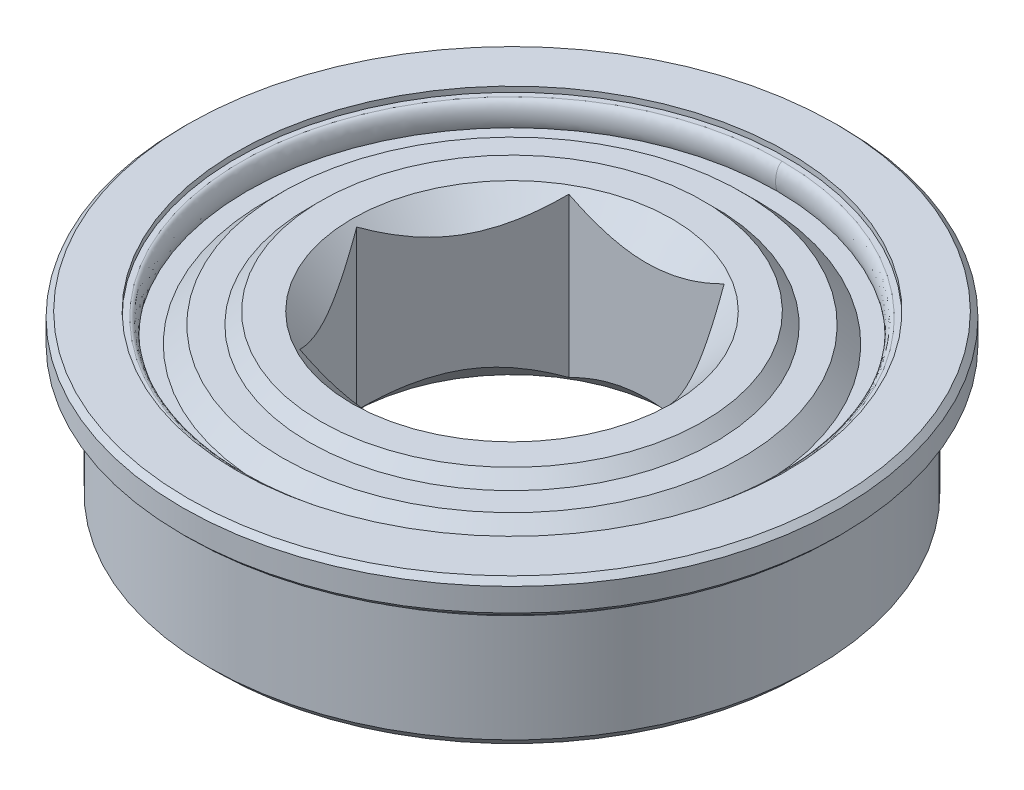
ISO-10303-21;
HEADER;
FILE_DESCRIPTION(('STEP AP214'),'2;1');
FILE_NAME('part.step','',(''),(''),'','','');
FILE_SCHEMA(('AUTOMOTIVE_DESIGN { 1 0 10303 214 1 1 1 1 }'));
ENDSEC;
DATA;
#1=APPLICATION_CONTEXT('core data for automotive mechanical design processes');
#2=APPLICATION_PROTOCOL_DEFINITION('international standard','automotive_design',2000,#1);
#3=PRODUCT_CONTEXT('',#1,'mechanical');
#4=PRODUCT('Part','Part','',(#3));
#5=PRODUCT_RELATED_PRODUCT_CATEGORY('part','',(#4));
#6=PRODUCT_DEFINITION_FORMATION('','',#4);
#7=PRODUCT_DEFINITION_CONTEXT('part definition',#1,'design');
#8=PRODUCT_DEFINITION('design','',#6,#7);
#9=PRODUCT_DEFINITION_SHAPE('','',#8);
#10=(LENGTH_UNIT() NAMED_UNIT(*) SI_UNIT(.MILLI.,.METRE.));
#11=(NAMED_UNIT(*) PLANE_ANGLE_UNIT() SI_UNIT($,.RADIAN.));
#12=(NAMED_UNIT(*) SI_UNIT($,.STERADIAN.) SOLID_ANGLE_UNIT());
#13=UNCERTAINTY_MEASURE_WITH_UNIT(LENGTH_MEASURE(1.E-05),#10,'distance_accuracy_value','');
#14=(GEOMETRIC_REPRESENTATION_CONTEXT(3) GLOBAL_UNCERTAINTY_ASSIGNED_CONTEXT((#13)) GLOBAL_UNIT_ASSIGNED_CONTEXT((#10,
#11,#12)) REPRESENTATION_CONTEXT('',''));
#15=CARTESIAN_POINT('',(0.,0.,0.));
#16=DIRECTION('',(0.,0.,1.));
#17=DIRECTION('',(1.,0.,0.));
#18=AXIS2_PLACEMENT_3D('',#15,#16,#17);
#19=CARTESIAN_POINT('',(0.,-0.254,-12.7635));
#20=CARTESIAN_POINT('',(-25.527,-0.253999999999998,-12.7635));
#21=CARTESIAN_POINT('',(-25.527,-0.254000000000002,12.7635));
#22=CARTESIAN_POINT('',(0.,-0.254,12.7635));
#23=CARTESIAN_POINT('',(0.,-0.254,-12.715836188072));
#24=CARTESIAN_POINT('',(-25.431672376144,-0.253999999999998,-12.715836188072));
#25=CARTESIAN_POINT('',(-25.4316723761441,-0.254000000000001,12.715836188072));
#26=CARTESIAN_POINT('',(0.,-0.254,12.715836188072));
#27=CARTESIAN_POINT('',(0.,-0.299750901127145,-12.6043840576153));
#28=CARTESIAN_POINT('',(-25.2087681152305,-0.299750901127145,-12.6043840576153));
#29=CARTESIAN_POINT('',(-25.2087681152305,-0.299750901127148,12.6043840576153));
#30=CARTESIAN_POINT('',(0.,-0.299750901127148,12.6043840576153));
#31=CARTESIAN_POINT('',(0.,-0.613709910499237,-12.4569624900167));
#32=CARTESIAN_POINT('',(-24.9139249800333,-0.613709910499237,-12.4569624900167));
#33=CARTESIAN_POINT('',(-24.9139249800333,-0.613709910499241,12.4569624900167));
#34=CARTESIAN_POINT('',(0.,-0.613709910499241,12.4569624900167));
#35=CARTESIAN_POINT('',(0.,-1.05375371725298,-12.432868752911));
#36=CARTESIAN_POINT('',(-24.8657375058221,-1.05375371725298,-12.432868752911));
#37=CARTESIAN_POINT('',(-24.8657375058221,-1.05375371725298,12.432868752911));
#38=CARTESIAN_POINT('',(0.,-1.05375371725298,12.432868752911));
#39=CARTESIAN_POINT('',(0.,-1.26712977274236,-12.4853764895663));
#40=CARTESIAN_POINT('',(-24.9707529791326,-1.26712977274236,-12.4853764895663));
#41=CARTESIAN_POINT('',(-24.9707529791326,-1.26712977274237,12.4853764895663));
#42=CARTESIAN_POINT('',(0.,-1.26712977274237,12.4853764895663));
#43=CARTESIAN_POINT('',(0.,-1.3462,-12.5150539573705));
#44=CARTESIAN_POINT('',(-25.030107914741,-1.3462,-12.5150539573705));
#45=CARTESIAN_POINT('',(-25.030107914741,-1.3462,12.5150539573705));
#46=CARTESIAN_POINT('',(0.,-1.3462,12.5150539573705));
#47=(BOUNDED_SURFACE() B_SPLINE_SURFACE(3,3,((#19,#20,#21,#22),(#23,#24,#25,#26),(#27,#28,#29,
#30),(#31,#32,#33,#34),(#35,#36,#37,#38),(#39,#40,#41,#42),(#43,#44,#45,#46)),.UNSPECIFIED.,.F.,
.F.,.F.) B_SPLINE_SURFACE_WITH_KNOTS((4,1,1,1,4),(4,4),(0.,0.25,0.5,0.75,1.),(0.,1.),
.UNSPECIFIED.) GEOMETRIC_REPRESENTATION_ITEM() RATIONAL_B_SPLINE_SURFACE(((1.,0.333333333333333,
0.333333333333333,1.),(1.,0.333333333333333,0.333333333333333,1.),(1.,0.333333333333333,
0.333333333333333,1.),(1.,0.333333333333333,0.333333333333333,1.),(1.,0.333333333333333,
0.333333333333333,1.),(1.,0.333333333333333,0.333333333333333,1.),(1.,0.333333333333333,
0.333333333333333,1.))) REPRESENTATION_ITEM('') SURFACE());
#48=CARTESIAN_POINT('',(0.,-0.254,0.));
#49=DIRECTION('',(0.,1.,0.));
#50=DIRECTION('',(0.,0.,1.));
#51=AXIS2_PLACEMENT_3D('',#48,#49,#50);
#52=CIRCLE('',#51,12.7635);
#53=CARTESIAN_POINT('',(0.,-0.254,-12.7635));
#54=VERTEX_POINT('',#53);
#55=CARTESIAN_POINT('',(0.,-0.254,12.7635));
#56=VERTEX_POINT('',#55);
#57=EDGE_CURVE('E518',#54,#56,#52,.T.);
#58=CARTESIAN_POINT('',(0.,-0.254,12.7635));
#59=CARTESIAN_POINT('',(0.,-0.254,12.715836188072));
#60=CARTESIAN_POINT('',(0.,-0.299750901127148,12.6043840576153));
#61=CARTESIAN_POINT('',(0.,-0.613709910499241,12.4569624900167));
#62=CARTESIAN_POINT('',(0.,-1.05375371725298,12.432868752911));
#63=CARTESIAN_POINT('',(0.,-1.26712977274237,12.4853764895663));
#64=CARTESIAN_POINT('',(0.,-1.3462,12.5150539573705));
#65=(BOUNDED_CURVE() B_SPLINE_CURVE(3,(#58,#59,#60,#61,#62,#63,#64),.UNSPECIFIED.,.F.,
.F.) B_SPLINE_CURVE_WITH_KNOTS((4,1,1,1,4),(0.,0.25,0.5,0.75,1.),
.UNSPECIFIED.) CURVE() GEOMETRIC_REPRESENTATION_ITEM() RATIONAL_B_SPLINE_CURVE((1.,1.,1.,1.,1.,
1.,1.)) REPRESENTATION_ITEM(''));
#66=CARTESIAN_POINT('',(0.,-1.3462,12.5150539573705));
#67=VERTEX_POINT('',#66);
#68=EDGE_CURVE('E476',#56,#67,#65,.T.);
#69=CARTESIAN_POINT('',(0.,-1.3462,0.));
#70=DIRECTION('',(0.,1.,0.));
#71=DIRECTION('',(0.,0.,1.));
#72=AXIS2_PLACEMENT_3D('',#69,#70,#71);
#73=CIRCLE('',#72,12.5150539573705);
#74=CARTESIAN_POINT('',(0.,-1.3462,-12.5150539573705));
#75=VERTEX_POINT('',#74);
#76=EDGE_CURVE('E521',#75,#67,#73,.T.);
#77=CARTESIAN_POINT('',(0.,-0.254,-12.7635));
#78=CARTESIAN_POINT('',(0.,-0.254,-12.715836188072));
#79=CARTESIAN_POINT('',(0.,-0.299750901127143,-12.6043840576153));
#80=CARTESIAN_POINT('',(0.,-0.613709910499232,-12.4569624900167));
#81=CARTESIAN_POINT('',(0.,-1.05375371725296,-12.432868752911));
#82=CARTESIAN_POINT('',(0.,-1.26712977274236,-12.4853764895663));
#83=CARTESIAN_POINT('',(0.,-1.3462,-12.5150539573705));
#84=(BOUNDED_CURVE() B_SPLINE_CURVE(3,(#77,#78,#79,#80,#81,#82,#83),.UNSPECIFIED.,.F.,
.F.) B_SPLINE_CURVE_WITH_KNOTS((4,1,1,1,4),(0.,0.25,0.5,0.75,1.),
.UNSPECIFIED.) CURVE() GEOMETRIC_REPRESENTATION_ITEM() RATIONAL_B_SPLINE_CURVE((1.,1.,1.,1.,1.,
1.,1.)) REPRESENTATION_ITEM(''));
#85=EDGE_CURVE('E517',#54,#75,#84,.T.);
#86=ORIENTED_EDGE('',*,*,#57,.T.);
#87=ORIENTED_EDGE('',*,*,#68,.T.);
#88=ORIENTED_EDGE('',*,*,#76,.F.);
#89=ORIENTED_EDGE('',*,*,#85,.F.);
#90=EDGE_LOOP('',(#86,#87,#88,#89));
#91=FACE_BOUND('',#90,.T.);
#92=ADVANCED_FACE('F16',(#91),#47,.F.);
#93=CARTESIAN_POINT('',(0.,-7.6835,12.7635));
#94=CARTESIAN_POINT('',(25.527,-7.6835,12.7635));
#95=CARTESIAN_POINT('',(25.527,-7.6835,-12.7635));
#96=CARTESIAN_POINT('',(0.,-7.6835,-12.7635));
#97=CARTESIAN_POINT('',(0.,-7.6835,12.715836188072));
#98=CARTESIAN_POINT('',(25.431672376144,-7.6835,12.715836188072));
#99=CARTESIAN_POINT('',(25.431672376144,-7.6835,-12.715836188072));
#100=CARTESIAN_POINT('',(0.,-7.6835,-12.715836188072));
#101=CARTESIAN_POINT('',(0.,-7.63774909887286,12.6043840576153));
#102=CARTESIAN_POINT('',(25.2087681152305,-7.63774909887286,12.6043840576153));
#103=CARTESIAN_POINT('',(25.2087681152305,-7.63774909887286,-12.6043840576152));
#104=CARTESIAN_POINT('',(0.,-7.63774909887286,-12.6043840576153));
#105=CARTESIAN_POINT('',(0.,-7.32379008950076,12.4569624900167));
#106=CARTESIAN_POINT('',(24.9139249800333,-7.32379008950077,12.4569624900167));
#107=CARTESIAN_POINT('',(24.9139249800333,-7.32379008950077,-12.4569624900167));
#108=CARTESIAN_POINT('',(0.,-7.32379008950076,-12.4569624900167));
#109=CARTESIAN_POINT('',(0.,-6.88374628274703,12.432868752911));
#110=CARTESIAN_POINT('',(24.8657375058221,-6.88374628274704,12.432868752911));
#111=CARTESIAN_POINT('',(24.8657375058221,-6.88374628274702,-12.432868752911));
#112=CARTESIAN_POINT('',(0.,-6.88374628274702,-12.432868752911));
#113=CARTESIAN_POINT('',(0.,-6.67037022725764,12.4853764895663));
#114=CARTESIAN_POINT('',(24.9707529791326,-6.67037022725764,12.4853764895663));
#115=CARTESIAN_POINT('',(24.9707529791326,-6.67037022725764,-12.4853764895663));
#116=CARTESIAN_POINT('',(0.,-6.67037022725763,-12.4853764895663));
#117=CARTESIAN_POINT('',(0.,-6.5913,12.5150539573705));
#118=CARTESIAN_POINT('',(25.030107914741,-6.59130000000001,12.5150539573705));
#119=CARTESIAN_POINT('',(25.030107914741,-6.59130000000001,-12.5150539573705));
#120=CARTESIAN_POINT('',(0.,-6.5913,-12.5150539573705));
#121=(BOUNDED_SURFACE() B_SPLINE_SURFACE(3,3,((#93,#94,#95,#96),(#97,#98,#99,#100),(#101,#102,
#103,#104),(#105,#106,#107,#108),(#109,#110,#111,#112),(#113,#114,#115,#116),(#117,#118,#119,
#120)),.UNSPECIFIED.,.F.,.F.,.F.) B_SPLINE_SURFACE_WITH_KNOTS((4,1,1,1,4),(4,4),(0.,0.25,0.5,
0.75,1.),(0.,1.),.UNSPECIFIED.) GEOMETRIC_REPRESENTATION_ITEM() RATIONAL_B_SPLINE_SURFACE(((1.,
0.333333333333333,0.333333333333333,1.),(1.,0.333333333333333,0.333333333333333,1.),(1.,
0.333333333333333,0.333333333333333,1.),(1.,0.333333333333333,0.333333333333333,1.),(1.,
0.333333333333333,0.333333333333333,1.),(1.,0.333333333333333,0.333333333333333,1.),(1.,
0.333333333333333,0.333333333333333,1.))) REPRESENTATION_ITEM('') SURFACE());
#122=CARTESIAN_POINT('',(0.,-7.6835,0.));
#123=DIRECTION('',(0.,1.,0.));
#124=DIRECTION('',(0.,0.,1.));
#125=AXIS2_PLACEMENT_3D('',#122,#123,#124);
#126=CIRCLE('',#125,12.7635);
#127=CARTESIAN_POINT('',(0.,-7.6835,12.7635));
#128=VERTEX_POINT('',#127);
#129=CARTESIAN_POINT('',(0.,-7.6835,-12.7635));
#130=VERTEX_POINT('',#129);
#131=EDGE_CURVE('E661',#128,#130,#126,.T.);
#132=CARTESIAN_POINT('',(0.,-7.6835,12.7635));
#133=CARTESIAN_POINT('',(0.,-7.6835,12.715836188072));
#134=CARTESIAN_POINT('',(0.,-7.63774909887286,12.6043840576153));
#135=CARTESIAN_POINT('',(0.,-7.32379008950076,12.4569624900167));
#136=CARTESIAN_POINT('',(0.,-6.88374628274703,12.432868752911));
#137=CARTESIAN_POINT('',(0.,-6.67037022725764,12.4853764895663));
#138=CARTESIAN_POINT('',(0.,-6.5913,12.5150539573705));
#139=(BOUNDED_CURVE() B_SPLINE_CURVE(3,(#132,#133,#134,#135,#136,#137,#138),.UNSPECIFIED.,.F.,
.F.) B_SPLINE_CURVE_WITH_KNOTS((4,1,1,1,4),(0.,0.25,0.5,0.75,1.),
.UNSPECIFIED.) CURVE() GEOMETRIC_REPRESENTATION_ITEM() RATIONAL_B_SPLINE_CURVE((1.,1.,1.,1.,1.,
1.,1.)) REPRESENTATION_ITEM(''));
#140=CARTESIAN_POINT('',(0.,-6.5913,12.5150539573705));
#141=VERTEX_POINT('',#140);
#142=EDGE_CURVE('E632',#128,#141,#139,.T.);
#143=CARTESIAN_POINT('',(0.,-6.5913,0.));
#144=DIRECTION('',(0.,1.,0.));
#145=DIRECTION('',(0.,0.,1.));
#146=AXIS2_PLACEMENT_3D('',#143,#144,#145);
#147=CIRCLE('',#146,12.5150539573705);
#148=CARTESIAN_POINT('',(0.,-6.5913,-12.5150539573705));
#149=VERTEX_POINT('',#148);
#150=EDGE_CURVE('E677',#141,#149,#147,.T.);
#151=CARTESIAN_POINT('',(0.,-7.6835,-12.7635));
#152=CARTESIAN_POINT('',(0.,-7.6835,-12.715836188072));
#153=CARTESIAN_POINT('',(0.,-7.63774909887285,-12.6043840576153));
#154=CARTESIAN_POINT('',(0.,-7.32379008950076,-12.4569624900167));
#155=CARTESIAN_POINT('',(0.,-6.88374628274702,-12.432868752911));
#156=CARTESIAN_POINT('',(0.,-6.67037022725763,-12.4853764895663));
#157=CARTESIAN_POINT('',(0.,-6.5913,-12.5150539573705));
#158=(BOUNDED_CURVE() B_SPLINE_CURVE(3,(#151,#152,#153,#154,#155,#156,#157),.UNSPECIFIED.,.F.,
.F.) B_SPLINE_CURVE_WITH_KNOTS((4,1,1,1,4),(0.,0.25,0.5,0.75,1.),
.UNSPECIFIED.) CURVE() GEOMETRIC_REPRESENTATION_ITEM() RATIONAL_B_SPLINE_CURVE((0.999999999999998,
0.999999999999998,0.999999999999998,0.999999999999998,0.999999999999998,0.999999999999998,0.999999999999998)) REPRESENTATION_ITEM(''));
#159=EDGE_CURVE('E586',#130,#149,#158,.T.);
#160=ORIENTED_EDGE('',*,*,#131,.F.);
#161=ORIENTED_EDGE('',*,*,#142,.T.);
#162=ORIENTED_EDGE('',*,*,#150,.T.);
#163=ORIENTED_EDGE('',*,*,#159,.F.);
#164=EDGE_LOOP('',(#160,#161,#162,#163));
#165=FACE_BOUND('',#164,.T.);
#166=ADVANCED_FACE('F437',(#165),#121,.T.);
#167=CARTESIAN_POINT('',(0.,-1.7272,0.));
#168=DIRECTION('',(0.,-1.,0.));
#169=DIRECTION('',(0.,0.,-1.));
#170=AXIS2_PLACEMENT_3D('',#167,#168,#169);
#171=TOROIDAL_SURFACE('',#170,14.224,0.127);
#172=CARTESIAN_POINT('',(0.,-1.7272,0.));
#173=DIRECTION('',(0.,-1.,0.));
#174=DIRECTION('',(0.,0.,-1.));
#175=AXIS2_PLACEMENT_3D('',#172,#173,#174);
#176=CIRCLE('',#175,14.097);
#177=CARTESIAN_POINT('',(0.,-1.7272,-14.097));
#178=VERTEX_POINT('',#177);
#179=EDGE_CURVE('E563',#178,#178,#176,.T.);
#180=ORIENTED_EDGE('',*,*,#179,.F.);
#181=EDGE_LOOP('',(#180));
#182=FACE_BOUND('',#181,.T.);
#183=CARTESIAN_POINT('',(0.,-1.6002,0.));
#184=DIRECTION('',(0.,1.,0.));
#185=DIRECTION('',(0.,0.,-1.));
#186=AXIS2_PLACEMENT_3D('',#183,#184,#185);
#187=CIRCLE('',#186,14.224);
#188=CARTESIAN_POINT('',(0.,-1.6002,-14.224));
#189=VERTEX_POINT('',#188);
#190=EDGE_CURVE('E571',#189,#189,#187,.T.);
#191=ORIENTED_EDGE('',*,*,#190,.F.);
#192=EDGE_LOOP('',(#191));
#193=FACE_BOUND('',#192,.T.);
#194=ADVANCED_FACE('F443',(#182,#193),#171,.F.);
#195=CARTESIAN_POINT('',(0.,-6.5913,0.));
#196=DIRECTION('',(0.,1.,0.));
#197=DIRECTION('',(0.,0.,1.));
#198=AXIS2_PLACEMENT_3D('',#195,#196,#197);
#199=CONICAL_SURFACE('',#198,11.6447517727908,0.78539816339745);
#200=CARTESIAN_POINT('',(0.,-7.37755177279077,0.));
#201=DIRECTION('',(0.,1.,0.));
#202=DIRECTION('',(0.,0.,1.));
#203=AXIS2_PLACEMENT_3D('',#200,#201,#202);
#204=CIRCLE('',#203,10.8585);
#205=CARTESIAN_POINT('',(0.,-7.37755177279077,10.8585));
#206=VERTEX_POINT('',#205);
#207=EDGE_CURVE('E777',#206,#206,#204,.T.);
#208=ORIENTED_EDGE('',*,*,#207,.T.);
#209=EDGE_LOOP('',(#208));
#210=FACE_BOUND('',#209,.T.);
#211=CARTESIAN_POINT('',(0.,-6.5913,0.));
#212=DIRECTION('',(0.,1.,0.));
#213=DIRECTION('',(0.,0.,1.));
#214=AXIS2_PLACEMENT_3D('',#211,#212,#213);
#215=CIRCLE('',#214,11.6447517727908);
#216=CARTESIAN_POINT('',(0.,-6.5913,11.6447517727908));
#217=VERTEX_POINT('',#216);
#218=EDGE_CURVE('E680',#217,#217,#215,.T.);
#219=ORIENTED_EDGE('',*,*,#218,.F.);
#220=EDGE_LOOP('',(#219));
#221=FACE_BOUND('',#220,.T.);
#222=ADVANCED_FACE('F18',(#210,#221),#199,.T.);
#223=CARTESIAN_POINT('',(0.,-7.37755177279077,0.));
#224=DIRECTION('',(0.,1.,0.));
#225=DIRECTION('',(0.,0.,1.));
#226=AXIS2_PLACEMENT_3D('',#223,#224,#225);
#227=CONICAL_SURFACE('',#226,9.5885,0.785398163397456);
#228=CARTESIAN_POINT('',(0.,-7.9375,0.));
#229=DIRECTION('',(0.,1.,0.));
#230=DIRECTION('',(0.,0.,1.));
#231=AXIS2_PLACEMENT_3D('',#228,#229,#230);
#232=CIRCLE('',#231,9.02855177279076);
#233=CARTESIAN_POINT('',(0.,-7.9375,9.02855177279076));
#234=VERTEX_POINT('',#233);
#235=EDGE_CURVE('E786',#234,#234,#232,.T.);
#236=ORIENTED_EDGE('',*,*,#235,.T.);
#237=EDGE_LOOP('',(#236));
#238=FACE_BOUND('',#237,.T.);
#239=CARTESIAN_POINT('',(0.,-7.37755177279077,0.));
#240=DIRECTION('',(0.,1.,0.));
#241=DIRECTION('',(0.,0.,1.));
#242=AXIS2_PLACEMENT_3D('',#239,#240,#241);
#243=CIRCLE('',#242,9.5885);
#244=CARTESIAN_POINT('',(0.,-7.37755177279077,9.5885));
#245=VERTEX_POINT('',#244);
#246=EDGE_CURVE('E780',#245,#245,#243,.T.);
#247=ORIENTED_EDGE('',*,*,#246,.F.);
#248=EDGE_LOOP('',(#247));
#249=FACE_BOUND('',#248,.T.);
#250=ADVANCED_FACE('F650',(#238,#249),#227,.T.);
#251=CARTESIAN_POINT('',(0.,-7.9375,0.));
#252=DIRECTION('',(0.,-1.,0.));
#253=DIRECTION('',(0.,0.,-1.));
#254=AXIS2_PLACEMENT_3D('',#251,#252,#253);
#255=CONICAL_SURFACE('',#254,7.5565,0.785398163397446);
#256=CARTESIAN_POINT('',(3.66617412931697,-7.71334837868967,6.35));
#257=CARTESIAN_POINT('',(2.73007217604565,-7.24529740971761,6.35));
#258=CARTESIAN_POINT('',(1.90239615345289,-7.00984689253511,6.35));
#259=CARTESIAN_POINT('',(0.9325645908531,-6.73395712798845,6.35));
#260=CARTESIAN_POINT('',(0.0148101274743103,-6.73101727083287,6.35));
#261=CARTESIAN_POINT('',(-0.90417224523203,-6.72807348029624,6.35));
#262=CARTESIAN_POINT('',(-1.8766583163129,-7.00250635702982,6.35));
#263=CARTESIAN_POINT('',(-2.72107309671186,-7.24079787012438,6.35));
#264=CARTESIAN_POINT('',(-3.66617412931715,-7.71334837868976,6.35));
#265=B_SPLINE_CURVE_WITH_KNOTS('',2,(#256,#257,#258,#259,#260,#261,#262,#263,#264),
.UNSPECIFIED.,.F.,.F.,(3,2,2,2,3),(0.,0.25,0.5,0.75,1.),.UNSPECIFIED.);
#266=CARTESIAN_POINT('',(3.66617422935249,-7.71334839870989,6.34999996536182));
#267=VERTEX_POINT('',#266);
#268=CARTESIAN_POINT('',(-3.6661742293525,-7.71334839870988,6.34999996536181));
#269=VERTEX_POINT('',#268);
#270=EDGE_CURVE('E694',#267,#269,#265,.T.);
#271=ORIENTED_EDGE('',*,*,#270,.F.);
#272=CARTESIAN_POINT('',(7.33234837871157,-7.71334837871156,6.92762852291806E-08));
#273=CARTESIAN_POINT('',(6.86385630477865,-7.24485631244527,0.811452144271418));
#274=CARTESIAN_POINT('',(6.44960505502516,-7.00935672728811,1.52895635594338));
#275=CARTESIAN_POINT('',(5.964880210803,-6.73379328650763,2.36852441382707));
#276=CARTESIAN_POINT('',(5.5060085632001,-6.73101433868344,3.16331342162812));
#277=CARTESIAN_POINT('',(5.04687441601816,-6.72823380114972,3.95855709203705));
#278=CARTESIAN_POINT('',(4.56118158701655,-7.00236498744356,4.7998017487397));
#279=CARTESIAN_POINT('',(4.13870846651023,-7.24081416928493,5.53154665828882));
#280=CARTESIAN_POINT('',(3.66617424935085,-7.71334837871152,6.34999993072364));
#281=B_SPLINE_CURVE_WITH_KNOTS('',2,(#272,#273,#274,#275,#276,#277,#278,#279,#280),
.UNSPECIFIED.,.F.,.F.,(3,2,2,2,3),(0.,0.25,0.5,0.75,1.),.UNSPECIFIED.);
#282=CARTESIAN_POINT('',(7.33234839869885,-7.71334839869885,-3.46572928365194E-08));
#283=VERTEX_POINT('',#282);
#284=EDGE_CURVE('E685',#283,#267,#281,.T.);
#285=ORIENTED_EDGE('',*,*,#284,.F.);
#286=CARTESIAN_POINT('',(3.66617424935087,-7.71334837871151,-6.34999993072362));
#287=CARTESIAN_POINT('',(4.13466632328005,-7.24485631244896,-5.53854785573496));
#288=CARTESIAN_POINT('',(4.54891757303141,-7.00935672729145,-4.8210436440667));
#289=CARTESIAN_POINT('',(5.03364241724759,-6.73379328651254,-3.98147558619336));
#290=CARTESIAN_POINT('',(5.49251406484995,-6.7310143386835,-3.18668657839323));
#291=CARTESIAN_POINT('',(5.95164821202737,-6.72823380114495,-2.39144290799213));
#292=CARTESIAN_POINT('',(6.43734104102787,-7.00236498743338,-1.5501982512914));
#293=CARTESIAN_POINT('',(6.85981416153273,-7.24081416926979,-0.818453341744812));
#294=CARTESIAN_POINT('',(7.33234837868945,-7.71334837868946,-6.93145876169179E-08));
#295=B_SPLINE_CURVE_WITH_KNOTS('',2,(#286,#287,#288,#289,#290,#291,#292,#293,#294),
.UNSPECIFIED.,.F.,.F.,(3,2,2,2,3),(0.,0.25,0.5,0.75,1.),.UNSPECIFIED.);
#296=CARTESIAN_POINT('',(3.66617416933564,-7.71334839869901,-6.35));
#297=VERTEX_POINT('',#296);
#298=EDGE_CURVE('E365',#297,#283,#295,.T.);
#299=ORIENTED_EDGE('',*,*,#298,.F.);
#300=CARTESIAN_POINT('',(-3.66617412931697,-7.71334837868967,-6.35));
#301=CARTESIAN_POINT('',(-2.7300721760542,-7.24529740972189,-6.35));
#302=CARTESIAN_POINT('',(-1.90239615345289,-7.0098468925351,-6.35));
#303=CARTESIAN_POINT('',(-0.93256459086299,-6.73395712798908,-6.35));
#304=CARTESIAN_POINT('',(-0.0148101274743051,-6.73101727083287,-6.35));
#305=CARTESIAN_POINT('',(0.90417224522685,-6.72807348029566,-6.35));
#306=CARTESIAN_POINT('',(1.8766583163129,-7.00250635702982,-6.35));
#307=CARTESIAN_POINT('',(2.72107309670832,-7.24079787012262,-6.35));
#308=CARTESIAN_POINT('',(3.66617412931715,-7.71334837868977,-6.35));
#309=B_SPLINE_CURVE_WITH_KNOTS('',2,(#300,#301,#302,#303,#304,#305,#306,#307,#308),
.UNSPECIFIED.,.F.,.F.,(3,2,2,2,3),(0.,0.25,0.5,0.75,1.),.UNSPECIFIED.);
#310=CARTESIAN_POINT('',(-3.66617422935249,-7.71334839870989,-6.34999996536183));
#311=VERTEX_POINT('',#310);
#312=EDGE_CURVE('E239',#311,#297,#309,.T.);
#313=ORIENTED_EDGE('',*,*,#312,.F.);
#314=CARTESIAN_POINT('',(-7.33234837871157,-7.71334837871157,-6.92762852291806E-08));
#315=CARTESIAN_POINT('',(-6.86385630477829,-7.24485631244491,-0.811452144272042));
#316=CARTESIAN_POINT('',(-6.44960505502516,-7.00935672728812,-1.52895635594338));
#317=CARTESIAN_POINT('',(-5.96488021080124,-6.73379328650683,-2.3685244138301));
#318=CARTESIAN_POINT('',(-5.5060085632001,-6.73101433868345,-3.16331342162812));
#319=CARTESIAN_POINT('',(-5.04687441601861,-6.72823380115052,-3.95855709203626));
#320=CARTESIAN_POINT('',(-4.56118158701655,-7.00236498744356,-4.7998017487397));
#321=CARTESIAN_POINT('',(-4.13870846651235,-7.24081416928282,-5.53154665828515));
#322=CARTESIAN_POINT('',(-3.66617424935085,-7.71334837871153,-6.34999993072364));
#323=B_SPLINE_CURVE_WITH_KNOTS('',2,(#314,#315,#316,#317,#318,#319,#320,#321,#322),
.UNSPECIFIED.,.F.,.F.,(3,2,2,2,3),(0.,0.25,0.5,0.75,1.),.UNSPECIFIED.);
#324=CARTESIAN_POINT('',(-7.33234839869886,-7.71334839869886,3.46572921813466E-08));
#325=VERTEX_POINT('',#324);
#326=EDGE_CURVE('E234',#325,#311,#323,.T.);
#327=ORIENTED_EDGE('',*,*,#326,.F.);
#328=CARTESIAN_POINT('',(-3.66617424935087,-7.71334837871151,6.34999993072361));
#329=CARTESIAN_POINT('',(-4.13466632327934,-7.24485631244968,5.53854785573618));
#330=CARTESIAN_POINT('',(-4.54891757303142,-7.00935672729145,4.82104364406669));
#331=CARTESIAN_POINT('',(-5.03364241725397,-6.73379328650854,3.9814755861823));
#332=CARTESIAN_POINT('',(-5.49251406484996,-6.7310143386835,3.18668657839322));
#333=CARTESIAN_POINT('',(-5.95164821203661,-6.72823380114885,2.39144290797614));
#334=CARTESIAN_POINT('',(-6.43734104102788,-7.00236498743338,1.55019825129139));
#335=CARTESIAN_POINT('',(-6.85981416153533,-7.24081416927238,0.818453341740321));
#336=CARTESIAN_POINT('',(-7.33234837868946,-7.71334837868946,6.93145828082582E-08));
#337=B_SPLINE_CURVE_WITH_KNOTS('',2,(#328,#329,#330,#331,#332,#333,#334,#335,#336),
.UNSPECIFIED.,.F.,.F.,(3,2,2,2,3),(0.,0.25,0.5,0.75,1.),.UNSPECIFIED.);
#338=EDGE_CURVE('E216',#269,#325,#337,.T.);
#339=ORIENTED_EDGE('',*,*,#338,.F.);
#340=EDGE_LOOP('',(#271,#285,#299,#313,#327,#339));
#341=FACE_BOUND('',#340,.T.);
#342=CARTESIAN_POINT('',(0.,-7.9375,0.));
#343=DIRECTION('',(0.,1.,0.));
#344=DIRECTION('',(0.,0.,1.));
#345=AXIS2_PLACEMENT_3D('',#342,#343,#344);
#346=CIRCLE('',#345,7.5565);
#347=CARTESIAN_POINT('',(0.,-7.9375,7.5565));
#348=VERTEX_POINT('',#347);
#349=EDGE_CURVE('E783',#348,#348,#346,.T.);
#350=ORIENTED_EDGE('',*,*,#349,.F.);
#351=EDGE_LOOP('',(#350));
#352=FACE_BOUND('',#351,.T.);
#353=ADVANCED_FACE('F236',(#341,#352),#255,.F.);
#354=CARTESIAN_POINT('',(0.,-1.2065,0.));
#355=DIRECTION('',(0.,1.,0.));
#356=DIRECTION('',(0.,0.,1.));
#357=AXIS2_PLACEMENT_3D('',#354,#355,#356);
#358=CONICAL_SURFACE('',#357,6.35,0.785398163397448);
#359=CARTESIAN_POINT('',(3.66617412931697,-0.22415162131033,-6.35));
#360=CARTESIAN_POINT('',(2.73007217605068,-0.692202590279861,-6.35));
#361=CARTESIAN_POINT('',(1.90239615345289,-0.92765310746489,-6.35));
#362=CARTESIAN_POINT('',(0.93256459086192,-1.20354287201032,-6.35));
#363=CARTESIAN_POINT('',(0.0148101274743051,-1.20648272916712,-6.35));
#364=CARTESIAN_POINT('',(-0.90417224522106,-1.20942651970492,-6.35));
#365=CARTESIAN_POINT('',(-1.8766583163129,-0.93499364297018,-6.35));
#366=CARTESIAN_POINT('',(-2.72107309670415,-0.69670212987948,-6.35));
#367=CARTESIAN_POINT('',(-3.66617412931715,-0.22415162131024,-6.35));
#368=B_SPLINE_CURVE_WITH_KNOTS('',2,(#359,#360,#361,#362,#363,#364,#365,#366,#367),
.UNSPECIFIED.,.F.,.F.,(3,2,2,2,3),(0.,0.25,0.5,0.75,1.),.UNSPECIFIED.);
#369=CARTESIAN_POINT('',(3.66617422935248,-0.224151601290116,-6.34999996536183));
#370=VERTEX_POINT('',#369);
#371=CARTESIAN_POINT('',(-3.6661742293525,-0.22415160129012,-6.34999996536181));
#372=VERTEX_POINT('',#371);
#373=EDGE_CURVE('E398',#370,#372,#368,.T.);
#374=ORIENTED_EDGE('',*,*,#373,.F.);
#375=CARTESIAN_POINT('',(7.33234837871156,-0.22415162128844,-6.92762920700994E-08));
#376=CARTESIAN_POINT('',(6.86385630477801,-0.692643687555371,-0.811452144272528));
#377=CARTESIAN_POINT('',(6.44960505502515,-0.92814327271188,-1.52895635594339));
#378=CARTESIAN_POINT('',(5.964880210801,-1.20370671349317,-2.36852441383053));
#379=CARTESIAN_POINT('',(5.5060085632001,-1.20648566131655,-3.16331342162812));
#380=CARTESIAN_POINT('',(5.04687441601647,-1.20926619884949,-3.95855709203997));
#381=CARTESIAN_POINT('',(4.56118158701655,-0.935135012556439,-4.79980174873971));
#382=CARTESIAN_POINT('',(4.13870846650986,-0.696685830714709,-5.53154665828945));
#383=CARTESIAN_POINT('',(3.66617424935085,-0.224151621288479,-6.34999993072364));
#384=B_SPLINE_CURVE_WITH_KNOTS('',2,(#375,#376,#377,#378,#379,#380,#381,#382,#383),
.UNSPECIFIED.,.F.,.F.,(3,2,2,2,3),(0.,0.25,0.5,0.75,1.),.UNSPECIFIED.);
#385=CARTESIAN_POINT('',(7.33234839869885,-0.224151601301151,3.46572916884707E-08));
#386=VERTEX_POINT('',#385);
#387=EDGE_CURVE('E393',#386,#370,#384,.T.);
#388=ORIENTED_EDGE('',*,*,#387,.F.);
#389=CARTESIAN_POINT('',(3.66617424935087,-0.224151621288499,6.34999993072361));
#390=CARTESIAN_POINT('',(4.13466632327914,-0.692643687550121,5.53854785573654));
#391=CARTESIAN_POINT('',(4.54891757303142,-0.928143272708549,4.82104364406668));
#392=CARTESIAN_POINT('',(5.03364241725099,-1.20370671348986,3.98147558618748));
#393=CARTESIAN_POINT('',(5.49251406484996,-1.2064856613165,3.18668657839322));
#394=CARTESIAN_POINT('',(5.95164821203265,-1.2092661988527,2.391442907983));
#395=CARTESIAN_POINT('',(6.43734104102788,-0.935135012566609,1.55019825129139));
#396=CARTESIAN_POINT('',(6.85981416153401,-0.696685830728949,0.818453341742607));
#397=CARTESIAN_POINT('',(7.33234837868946,-0.224151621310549,6.93145827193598E-08));
#398=B_SPLINE_CURVE_WITH_KNOTS('',2,(#389,#390,#391,#392,#393,#394,#395,#396,#397),
.UNSPECIFIED.,.F.,.F.,(3,2,2,2,3),(0.,0.25,0.5,0.75,1.),.UNSPECIFIED.);
#399=CARTESIAN_POINT('',(3.66617416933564,-0.224151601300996,6.35));
#400=VERTEX_POINT('',#399);
#401=EDGE_CURVE('E395',#400,#386,#398,.T.);
#402=ORIENTED_EDGE('',*,*,#401,.F.);
#403=CARTESIAN_POINT('',(-3.66617412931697,-0.22415162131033,6.35));
#404=CARTESIAN_POINT('',(-2.73007217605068,-0.69220259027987,6.35));
#405=CARTESIAN_POINT('',(-1.90239615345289,-0.92765310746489,6.35));
#406=CARTESIAN_POINT('',(-0.93256459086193,-1.20354287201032,6.35));
#407=CARTESIAN_POINT('',(-0.0148101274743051,-1.20648272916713,6.35));
#408=CARTESIAN_POINT('',(0.90417224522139,-1.20942651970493,6.35));
#409=CARTESIAN_POINT('',(1.8766583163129,-0.93499364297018,6.35));
#410=CARTESIAN_POINT('',(2.72107309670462,-0.69670212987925,6.35));
#411=CARTESIAN_POINT('',(3.66617412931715,-0.22415162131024,6.35));
#412=B_SPLINE_CURVE_WITH_KNOTS('',2,(#403,#404,#405,#406,#407,#408,#409,#410,#411),
.UNSPECIFIED.,.F.,.F.,(3,2,2,2,3),(0.,0.25,0.5,0.75,1.),.UNSPECIFIED.);
#413=CARTESIAN_POINT('',(-3.66617422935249,-0.224151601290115,6.34999996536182));
#414=VERTEX_POINT('',#413);
#415=EDGE_CURVE('E230',#414,#400,#412,.T.);
#416=ORIENTED_EDGE('',*,*,#415,.F.);
#417=CARTESIAN_POINT('',(-7.33234837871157,-0.22415162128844,6.92762885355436E-08));
#418=CARTESIAN_POINT('',(-6.86385630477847,-0.692643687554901,0.811452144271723));
#419=CARTESIAN_POINT('',(-6.44960505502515,-0.92814327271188,1.52895635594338));
#420=CARTESIAN_POINT('',(-5.9648802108,-1.20370671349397,2.36852441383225));
#421=CARTESIAN_POINT('',(-5.5060085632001,-1.20648566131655,3.16331342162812));
#422=CARTESIAN_POINT('',(-5.04687441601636,-1.2092661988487,3.95855709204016));
#423=CARTESIAN_POINT('',(-4.56118158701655,-0.93513501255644,4.7998017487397));
#424=CARTESIAN_POINT('',(-4.13870846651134,-0.69668583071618,5.5315466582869));
#425=CARTESIAN_POINT('',(-3.66617424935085,-0.22415162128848,6.34999993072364));
#426=B_SPLINE_CURVE_WITH_KNOTS('',2,(#417,#418,#419,#420,#421,#422,#423,#424,#425),
.UNSPECIFIED.,.F.,.F.,(3,2,2,2,3),(0.,0.25,0.5,0.75,1.),.UNSPECIFIED.);
#427=CARTESIAN_POINT('',(-7.33234839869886,-0.224151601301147,-3.46572903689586E-08));
#428=VERTEX_POINT('',#427);
#429=EDGE_CURVE('E246',#428,#414,#426,.T.);
#430=ORIENTED_EDGE('',*,*,#429,.F.);
#431=CARTESIAN_POINT('',(-3.66617424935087,-0.224151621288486,-6.34999993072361));
#432=CARTESIAN_POINT('',(-4.1346663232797,-0.692643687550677,-5.53854785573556));
#433=CARTESIAN_POINT('',(-4.54891757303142,-0.928143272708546,-4.82104364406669));
#434=CARTESIAN_POINT('',(-5.03364241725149,-1.20370671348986,-3.98147558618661));
#435=CARTESIAN_POINT('',(-5.49251406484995,-1.2064856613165,-3.18668657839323));
#436=CARTESIAN_POINT('',(-5.95164821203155,-1.2092661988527,-2.3914429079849));
#437=CARTESIAN_POINT('',(-6.43734104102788,-0.935135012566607,-1.55019825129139));
#438=CARTESIAN_POINT('',(-6.85981416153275,-0.696685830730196,-0.818453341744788));
#439=CARTESIAN_POINT('',(-7.33234837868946,-0.224151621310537,-6.9314581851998E-08));
#440=B_SPLINE_CURVE_WITH_KNOTS('',2,(#431,#432,#433,#434,#435,#436,#437,#438,#439),
.UNSPECIFIED.,.F.,.F.,(3,2,2,2,3),(0.,0.25,0.5,0.75,1.),.UNSPECIFIED.);
#441=EDGE_CURVE('E250',#372,#428,#440,.T.);
#442=ORIENTED_EDGE('',*,*,#441,.F.);
#443=EDGE_LOOP('',(#374,#388,#402,#416,#430,#442));
#444=FACE_BOUND('',#443,.T.);
#445=CARTESIAN_POINT('',(0.,0.,0.));
#446=DIRECTION('',(0.,1.,0.));
#447=DIRECTION('',(0.,0.,1.));
#448=AXIS2_PLACEMENT_3D('',#445,#446,#447);
#449=CIRCLE('',#448,7.5565);
#450=CARTESIAN_POINT('',(0.,0.,7.5565));
#451=VERTEX_POINT('',#450);
#452=EDGE_CURVE('E790',#451,#451,#449,.T.);
#453=ORIENTED_EDGE('',*,*,#452,.T.);
#454=EDGE_LOOP('',(#453));
#455=FACE_BOUND('',#454,.T.);
#456=ADVANCED_FACE('F321',(#444,#455),#358,.F.);
#457=CARTESIAN_POINT('',(0.,-0.559948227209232,0.));
#458=DIRECTION('',(0.,-1.,0.));
#459=DIRECTION('',(0.,0.,-1.));
#460=AXIS2_PLACEMENT_3D('',#457,#458,#459);
#461=CONICAL_SURFACE('',#460,9.5885,0.785398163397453);
#462=CARTESIAN_POINT('',(0.,0.,0.));
#463=DIRECTION('',(0.,1.,0.));
#464=DIRECTION('',(0.,0.,1.));
#465=AXIS2_PLACEMENT_3D('',#462,#463,#464);
#466=CIRCLE('',#465,9.02855177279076);
#467=CARTESIAN_POINT('',(0.,0.,9.02855177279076));
#468=VERTEX_POINT('',#467);
#469=EDGE_CURVE('E555',#468,#468,#466,.T.);
#470=ORIENTED_EDGE('',*,*,#469,.F.);
#471=EDGE_LOOP('',(#470));
#472=FACE_BOUND('',#471,.T.);
#473=CARTESIAN_POINT('',(0.,-0.559948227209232,0.));
#474=DIRECTION('',(0.,1.,0.));
#475=DIRECTION('',(0.,0.,1.));
#476=AXIS2_PLACEMENT_3D('',#473,#474,#475);
#477=CIRCLE('',#476,9.5885);
#478=CARTESIAN_POINT('',(0.,-0.559948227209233,9.5885));
#479=VERTEX_POINT('',#478);
#480=EDGE_CURVE('E543',#479,#479,#477,.T.);
#481=ORIENTED_EDGE('',*,*,#480,.T.);
#482=EDGE_LOOP('',(#481));
#483=FACE_BOUND('',#482,.T.);
#484=ADVANCED_FACE('F330',(#472,#483),#461,.T.);
#485=CARTESIAN_POINT('',(0.,-1.3462,0.));
#486=DIRECTION('',(0.,-1.,0.));
#487=DIRECTION('',(0.,0.,-1.));
#488=AXIS2_PLACEMENT_3D('',#485,#486,#487);
#489=CONICAL_SURFACE('',#488,11.6447517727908,0.785398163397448);
#490=CARTESIAN_POINT('',(0.,-0.559948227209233,0.));
#491=DIRECTION('',(0.,1.,0.));
#492=DIRECTION('',(0.,0.,1.));
#493=AXIS2_PLACEMENT_3D('',#490,#491,#492);
#494=CIRCLE('',#493,10.8585);
#495=CARTESIAN_POINT('',(0.,-0.559948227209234,10.8585));
#496=VERTEX_POINT('',#495);
#497=EDGE_CURVE('E548',#496,#496,#494,.T.);
#498=ORIENTED_EDGE('',*,*,#497,.F.);
#499=EDGE_LOOP('',(#498));
#500=FACE_BOUND('',#499,.T.);
#501=CARTESIAN_POINT('',(0.,-1.3462,0.));
#502=DIRECTION('',(0.,1.,0.));
#503=DIRECTION('',(0.,0.,1.));
#504=AXIS2_PLACEMENT_3D('',#501,#502,#503);
#505=CIRCLE('',#504,11.6447517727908);
#506=CARTESIAN_POINT('',(0.,-1.3462,11.6447517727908));
#507=VERTEX_POINT('',#506);
#508=EDGE_CURVE('E532',#507,#507,#505,.T.);
#509=ORIENTED_EDGE('',*,*,#508,.T.);
#510=EDGE_LOOP('',(#509));
#511=FACE_BOUND('',#510,.T.);
#512=ADVANCED_FACE('F331',(#500,#511),#489,.T.);
#513=CARTESIAN_POINT('',(0.,0.,0.));
#514=DIRECTION('',(0.,1.,0.));
#515=DIRECTION('',(0.,0.,1.));
#516=AXIS2_PLACEMENT_3D('',#513,#514,#515);
#517=CYLINDRICAL_SURFACE('',#516,13.0175);
#518=CARTESIAN_POINT('',(0.,-0.254,0.));
#519=DIRECTION('',(0.,1.,0.));
#520=DIRECTION('',(0.,0.,1.));
#521=AXIS2_PLACEMENT_3D('',#518,#519,#520);
#522=CIRCLE('',#521,13.0175);
#523=CARTESIAN_POINT('',(0.,-0.254,13.0175));
#524=VERTEX_POINT('',#523);
#525=EDGE_CURVE('E524',#524,#524,#522,.T.);
#526=ORIENTED_EDGE('',*,*,#525,.F.);
#527=EDGE_LOOP('',(#526));
#528=FACE_BOUND('',#527,.T.);
#529=CARTESIAN_POINT('',(0.,0.,0.));
#530=DIRECTION('',(0.,1.,0.));
#531=DIRECTION('',(0.,0.,1.));
#532=AXIS2_PLACEMENT_3D('',#529,#530,#531);
#533=CIRCLE('',#532,13.0175);
#534=CARTESIAN_POINT('',(0.,0.,13.0175));
#535=VERTEX_POINT('',#534);
#536=EDGE_CURVE('E570',#535,#535,#533,.T.);
#537=ORIENTED_EDGE('',*,*,#536,.T.);
#538=EDGE_LOOP('',(#537));
#539=FACE_BOUND('',#538,.T.);
#540=ADVANCED_FACE('F806',(#528,#539),#517,.F.);
#541=CARTESIAN_POINT('',(0.,0.,0.));
#542=DIRECTION('',(0.,-1.,0.));
#543=DIRECTION('',(0.,0.,-1.));
#544=AXIS2_PLACEMENT_3D('',#541,#542,#543);
#545=CONICAL_SURFACE('',#544,15.3035,0.785398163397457);
#546=CARTESIAN_POINT('',(0.,0.,0.));
#547=DIRECTION('',(0.,1.,0.));
#548=DIRECTION('',(0.,0.,1.));
#549=AXIS2_PLACEMENT_3D('',#546,#547,#548);
#550=CIRCLE('',#549,15.3035);
#551=CARTESIAN_POINT('',(0.,0.,15.3035));
#552=VERTEX_POINT('',#551);
#553=EDGE_CURVE('E566',#552,#552,#550,.T.);
#554=ORIENTED_EDGE('',*,*,#553,.F.);
#555=EDGE_LOOP('',(#554));
#556=FACE_BOUND('',#555,.T.);
#557=CARTESIAN_POINT('',(0.,-0.254,0.));
#558=DIRECTION('',(0.,1.,0.));
#559=DIRECTION('',(0.,0.,1.));
#560=AXIS2_PLACEMENT_3D('',#557,#558,#559);
#561=CIRCLE('',#560,15.5575);
#562=CARTESIAN_POINT('',(0.,-0.254,15.5575));
#563=VERTEX_POINT('',#562);
#564=EDGE_CURVE('E10',#563,#563,#561,.T.);
#565=ORIENTED_EDGE('',*,*,#564,.T.);
#566=EDGE_LOOP('',(#565));
#567=FACE_BOUND('',#566,.T.);
#568=ADVANCED_FACE('F820',(#556,#567),#545,.T.);
#569=CARTESIAN_POINT('',(0.,0.,0.));
#570=DIRECTION('',(0.,1.,0.));
#571=DIRECTION('',(0.,0.,1.));
#572=AXIS2_PLACEMENT_3D('',#569,#570,#571);
#573=CYLINDRICAL_SURFACE('',#572,15.5575);
#574=CARTESIAN_POINT('',(0.,-1.3462,0.));
#575=DIRECTION('',(0.,1.,0.));
#576=DIRECTION('',(0.,0.,1.));
#577=AXIS2_PLACEMENT_3D('',#574,#575,#576);
#578=CIRCLE('',#577,15.5575);
#579=CARTESIAN_POINT('',(0.,-1.3462,15.5575));
#580=VERTEX_POINT('',#579);
#581=EDGE_CURVE('E28',#580,#580,#578,.T.);
#582=ORIENTED_EDGE('',*,*,#581,.T.);
#583=EDGE_LOOP('',(#582));
#584=FACE_BOUND('',#583,.T.);
#585=ORIENTED_EDGE('',*,*,#564,.F.);
#586=EDGE_LOOP('',(#585));
#587=FACE_BOUND('',#586,.T.);
#588=ADVANCED_FACE('F380',(#584,#587),#573,.T.);
#589=CARTESIAN_POINT('',(0.,-1.6002,0.));
#590=DIRECTION('',(0.,1.,0.));
#591=DIRECTION('',(0.,0.,1.));
#592=AXIS2_PLACEMENT_3D('',#589,#590,#591);
#593=CONICAL_SURFACE('',#592,15.3035,0.785398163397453);
#594=CARTESIAN_POINT('',(0.,-1.6002,0.));
#595=DIRECTION('',(0.,1.,0.));
#596=DIRECTION('',(0.,0.,1.));
#597=AXIS2_PLACEMENT_3D('',#594,#595,#596);
#598=CIRCLE('',#597,15.3035);
#599=CARTESIAN_POINT('',(0.,-1.6002,15.3035));
#600=VERTEX_POINT('',#599);
#601=EDGE_CURVE('E569',#600,#600,#598,.T.);
#602=ORIENTED_EDGE('',*,*,#601,.T.);
#603=EDGE_LOOP('',(#602));
#604=FACE_BOUND('',#603,.T.);
#605=ORIENTED_EDGE('',*,*,#581,.F.);
#606=EDGE_LOOP('',(#605));
#607=FACE_BOUND('',#606,.T.);
#608=ADVANCED_FACE('F816',(#604,#607),#593,.T.);
#609=CARTESIAN_POINT('',(0.,0.,0.));
#610=DIRECTION('',(0.,1.,0.));
#611=DIRECTION('',(0.,0.,1.));
#612=AXIS2_PLACEMENT_3D('',#609,#610,#611);
#613=CYLINDRICAL_SURFACE('',#612,14.097);
#614=CARTESIAN_POINT('',(0.,-2.159,0.));
#615=DIRECTION('',(0.,1.,0.));
#616=DIRECTION('',(0.,0.,1.));
#617=AXIS2_PLACEMENT_3D('',#614,#615,#616);
#618=CIRCLE('',#617,14.097);
#619=CARTESIAN_POINT('',(0.,-2.159,14.097));
#620=VERTEX_POINT('',#619);
#621=EDGE_CURVE('E589',#620,#620,#618,.T.);
#622=ORIENTED_EDGE('',*,*,#621,.T.);
#623=EDGE_LOOP('',(#622));
#624=FACE_BOUND('',#623,.T.);
#625=ORIENTED_EDGE('',*,*,#179,.T.);
#626=EDGE_LOOP('',(#625));
#627=FACE_BOUND('',#626,.T.);
#628=ADVANCED_FACE('F294',(#624,#627),#613,.T.);
#629=CARTESIAN_POINT('',(0.,-2.3495,0.));
#630=DIRECTION('',(0.,-1.,0.));
#631=DIRECTION('',(0.,0.,-1.));
#632=AXIS2_PLACEMENT_3D('',#629,#630,#631);
#633=CONICAL_SURFACE('',#632,14.2875,0.785398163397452);
#634=ORIENTED_EDGE('',*,*,#621,.F.);
#635=EDGE_LOOP('',(#634));
#636=FACE_BOUND('',#635,.T.);
#637=CARTESIAN_POINT('',(0.,-2.3495,0.));
#638=DIRECTION('',(0.,1.,0.));
#639=DIRECTION('',(0.,0.,1.));
#640=AXIS2_PLACEMENT_3D('',#637,#638,#639);
#641=CIRCLE('',#640,14.2875);
#642=CARTESIAN_POINT('',(0.,-2.3495,14.2875));
#643=VERTEX_POINT('',#642);
#644=EDGE_CURVE('E585',#643,#643,#641,.T.);
#645=ORIENTED_EDGE('',*,*,#644,.T.);
#646=EDGE_LOOP('',(#645));
#647=FACE_BOUND('',#646,.T.);
#648=ADVANCED_FACE('F282',(#636,#647),#633,.T.);
#649=CARTESIAN_POINT('',(0.,0.,0.));
#650=DIRECTION('',(0.,1.,0.));
#651=DIRECTION('',(0.,0.,1.));
#652=AXIS2_PLACEMENT_3D('',#649,#650,#651);
#653=CYLINDRICAL_SURFACE('',#652,14.2875);
#654=CARTESIAN_POINT('',(0.,-7.4295,0.));
#655=DIRECTION('',(0.,1.,0.));
#656=DIRECTION('',(0.,0.,1.));
#657=AXIS2_PLACEMENT_3D('',#654,#655,#656);
#658=CIRCLE('',#657,14.2875);
#659=CARTESIAN_POINT('',(0.,-7.4295,14.2875));
#660=VERTEX_POINT('',#659);
#661=EDGE_CURVE('E582',#660,#660,#658,.T.);
#662=ORIENTED_EDGE('',*,*,#661,.T.);
#663=EDGE_LOOP('',(#662));
#664=FACE_BOUND('',#663,.T.);
#665=ORIENTED_EDGE('',*,*,#644,.F.);
#666=EDGE_LOOP('',(#665));
#667=FACE_BOUND('',#666,.T.);
#668=ADVANCED_FACE('F293',(#664,#667),#653,.T.);
#669=CARTESIAN_POINT('',(0.,-7.4295,0.));
#670=DIRECTION('',(0.,1.,0.));
#671=DIRECTION('',(0.,0.,1.));
#672=AXIS2_PLACEMENT_3D('',#669,#670,#671);
#673=CONICAL_SURFACE('',#672,14.2875,0.785398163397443);
#674=CARTESIAN_POINT('',(0.,-7.9375,0.));
#675=DIRECTION('',(0.,1.,0.));
#676=DIRECTION('',(0.,0.,1.));
#677=AXIS2_PLACEMENT_3D('',#674,#675,#676);
#678=CIRCLE('',#677,13.7795);
#679=CARTESIAN_POINT('',(0.,-7.9375,13.7795));
#680=VERTEX_POINT('',#679);
#681=EDGE_CURVE('E574',#680,#680,#678,.T.);
#682=ORIENTED_EDGE('',*,*,#681,.T.);
#683=EDGE_LOOP('',(#682));
#684=FACE_BOUND('',#683,.T.);
#685=ORIENTED_EDGE('',*,*,#661,.F.);
#686=EDGE_LOOP('',(#685));
#687=FACE_BOUND('',#686,.T.);
#688=ADVANCED_FACE('F810',(#684,#687),#673,.T.);
#689=CARTESIAN_POINT('',(0.,0.,0.));
#690=DIRECTION('',(0.,1.,0.));
#691=DIRECTION('',(0.,0.,1.));
#692=AXIS2_PLACEMENT_3D('',#689,#690,#691);
#693=CYLINDRICAL_SURFACE('',#692,13.0175);
#694=CARTESIAN_POINT('',(0.,-7.9375,0.));
#695=DIRECTION('',(0.,1.,0.));
#696=DIRECTION('',(0.,0.,1.));
#697=AXIS2_PLACEMENT_3D('',#694,#695,#696);
#698=CIRCLE('',#697,13.0175);
#699=CARTESIAN_POINT('',(0.,-7.9375,13.0175));
#700=VERTEX_POINT('',#699);
#701=EDGE_CURVE('E575',#700,#700,#698,.T.);
#702=ORIENTED_EDGE('',*,*,#701,.F.);
#703=EDGE_LOOP('',(#702));
#704=FACE_BOUND('',#703,.T.);
#705=CARTESIAN_POINT('',(0.,-7.6835,0.));
#706=DIRECTION('',(0.,1.,0.));
#707=DIRECTION('',(0.,0.,1.));
#708=AXIS2_PLACEMENT_3D('',#705,#706,#707);
#709=CIRCLE('',#708,13.0175);
#710=CARTESIAN_POINT('',(0.,-7.6835,13.0175));
#711=VERTEX_POINT('',#710);
#712=EDGE_CURVE('E578',#711,#711,#709,.T.);
#713=ORIENTED_EDGE('',*,*,#712,.T.);
#714=EDGE_LOOP('',(#713));
#715=FACE_BOUND('',#714,.T.);
#716=ADVANCED_FACE('F615',(#704,#715),#693,.F.);
#717=CARTESIAN_POINT('',(0.,-7.6835,-12.7635));
#718=CARTESIAN_POINT('',(-25.527,-7.6835,-12.7635));
#719=CARTESIAN_POINT('',(-25.527,-7.6835,12.7635));
#720=CARTESIAN_POINT('',(0.,-7.6835,12.7635));
#721=CARTESIAN_POINT('',(0.,-7.6835,-12.715836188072));
#722=CARTESIAN_POINT('',(-25.431672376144,-7.6835,-12.715836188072));
#723=CARTESIAN_POINT('',(-25.4316723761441,-7.6835,12.715836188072));
#724=CARTESIAN_POINT('',(0.,-7.6835,12.715836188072));
#725=CARTESIAN_POINT('',(0.,-7.63774909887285,-12.6043840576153));
#726=CARTESIAN_POINT('',(-25.2087681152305,-7.63774909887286,-12.6043840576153));
#727=CARTESIAN_POINT('',(-25.2087681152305,-7.63774909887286,12.6043840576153));
#728=CARTESIAN_POINT('',(0.,-7.63774909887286,12.6043840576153));
#729=CARTESIAN_POINT('',(0.,-7.32379008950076,-12.4569624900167));
#730=CARTESIAN_POINT('',(-24.9139249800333,-7.32379008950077,-12.4569624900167));
#731=CARTESIAN_POINT('',(-24.9139249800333,-7.32379008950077,12.4569624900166));
#732=CARTESIAN_POINT('',(0.,-7.32379008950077,12.4569624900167));
#733=CARTESIAN_POINT('',(0.,-6.88374628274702,-12.432868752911));
#734=CARTESIAN_POINT('',(-24.865737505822,-6.88374628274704,-12.432868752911));
#735=CARTESIAN_POINT('',(-24.8657375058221,-6.88374628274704,12.432868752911));
#736=CARTESIAN_POINT('',(0.,-6.88374628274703,12.432868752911));
#737=CARTESIAN_POINT('',(0.,-6.67037022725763,-12.4853764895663));
#738=CARTESIAN_POINT('',(-24.9707529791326,-6.67037022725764,-12.4853764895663));
#739=CARTESIAN_POINT('',(-24.9707529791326,-6.67037022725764,12.4853764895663));
#740=CARTESIAN_POINT('',(0.,-6.67037022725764,12.4853764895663));
#741=CARTESIAN_POINT('',(0.,-6.5913,-12.5150539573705));
#742=CARTESIAN_POINT('',(-25.030107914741,-6.59130000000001,-12.5150539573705));
#743=CARTESIAN_POINT('',(-25.030107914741,-6.59130000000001,12.5150539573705));
#744=CARTESIAN_POINT('',(0.,-6.5913,12.5150539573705));
#745=(BOUNDED_SURFACE() B_SPLINE_SURFACE(3,3,((#717,#718,#719,#720),(#721,#722,#723,#724),(#725,
#726,#727,#728),(#729,#730,#731,#732),(#733,#734,#735,#736),(#737,#738,#739,#740),(#741,#742,
#743,#744)),.UNSPECIFIED.,.F.,.F.,.F.) B_SPLINE_SURFACE_WITH_KNOTS((4,1,1,1,4),(4,4),(0.,0.25,
0.5,0.75,1.),(0.,1.),
.UNSPECIFIED.) GEOMETRIC_REPRESENTATION_ITEM() RATIONAL_B_SPLINE_SURFACE(((1.,0.333333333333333,
0.333333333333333,1.),(1.,0.333333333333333,0.333333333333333,1.),(1.,0.333333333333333,
0.333333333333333,1.),(1.,0.333333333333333,0.333333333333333,1.),(1.,0.333333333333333,
0.333333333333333,1.),(1.,0.333333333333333,0.333333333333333,1.),(1.,0.333333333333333,
0.333333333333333,1.))) REPRESENTATION_ITEM('') SURFACE());
#746=CARTESIAN_POINT('',(0.,-7.6835,0.));
#747=DIRECTION('',(0.,1.,0.));
#748=DIRECTION('',(0.,0.,1.));
#749=AXIS2_PLACEMENT_3D('',#746,#747,#748);
#750=CIRCLE('',#749,12.7635);
#751=EDGE_CURVE('E581',#130,#128,#750,.T.);
#752=CARTESIAN_POINT('',(0.,-6.5913,0.));
#753=DIRECTION('',(0.,1.,0.));
#754=DIRECTION('',(0.,0.,1.));
#755=AXIS2_PLACEMENT_3D('',#752,#753,#754);
#756=CIRCLE('',#755,12.5150539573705);
#757=EDGE_CURVE('E681',#149,#141,#756,.T.);
#758=ORIENTED_EDGE('',*,*,#142,.F.);
#759=ORIENTED_EDGE('',*,*,#751,.F.);
#760=ORIENTED_EDGE('',*,*,#159,.T.);
#761=ORIENTED_EDGE('',*,*,#757,.T.);
#762=EDGE_LOOP('',(#758,#759,#760,#761));
#763=FACE_BOUND('',#762,.T.);
#764=ADVANCED_FACE('F602',(#763),#745,.T.);
#765=CARTESIAN_POINT('',(0.,-7.6835,0.));
#766=DIRECTION('',(0.,-1.,0.));
#767=DIRECTION('',(0.,0.,-1.));
#768=AXIS2_PLACEMENT_3D('',#765,#766,#767);
#769=PLANE('',#768);
#770=ORIENTED_EDGE('',*,*,#751,.T.);
#771=ORIENTED_EDGE('',*,*,#131,.T.);
#772=EDGE_LOOP('',(#770,#771));
#773=FACE_BOUND('',#772,.T.);
#774=ORIENTED_EDGE('',*,*,#712,.F.);
#775=EDGE_LOOP('',(#774));
#776=FACE_BOUND('',#775,.T.);
#777=ADVANCED_FACE('F614',(#773,#776),#769,.T.);
#778=CARTESIAN_POINT('',(0.,-7.9375,0.));
#779=DIRECTION('',(0.,-1.,0.));
#780=DIRECTION('',(0.,0.,-1.));
#781=AXIS2_PLACEMENT_3D('',#778,#779,#780);
#782=PLANE('',#781);
#783=ORIENTED_EDGE('',*,*,#701,.T.);
#784=EDGE_LOOP('',(#783));
#785=FACE_BOUND('',#784,.T.);
#786=ORIENTED_EDGE('',*,*,#681,.F.);
#787=EDGE_LOOP('',(#786));
#788=FACE_BOUND('',#787,.T.);
#789=ADVANCED_FACE('F839',(#785,#788),#782,.T.);
#790=CARTESIAN_POINT('',(0.,-1.6002,0.));
#791=DIRECTION('',(0.,-1.,0.));
#792=DIRECTION('',(0.,0.,-1.));
#793=AXIS2_PLACEMENT_3D('',#790,#791,#792);
#794=PLANE('',#793);
#795=ORIENTED_EDGE('',*,*,#190,.T.);
#796=EDGE_LOOP('',(#795));
#797=FACE_BOUND('',#796,.T.);
#798=ORIENTED_EDGE('',*,*,#601,.F.);
#799=EDGE_LOOP('',(#798));
#800=FACE_BOUND('',#799,.T.);
#801=ADVANCED_FACE('F497',(#797,#800),#794,.T.);
#802=CARTESIAN_POINT('',(0.,0.,0.));
#803=DIRECTION('',(0.,1.,0.));
#804=DIRECTION('',(1.,0.,0.));
#805=AXIS2_PLACEMENT_3D('',#802,#803,#804);
#806=PLANE('',#805);
#807=ORIENTED_EDGE('',*,*,#553,.T.);
#808=EDGE_LOOP('',(#807));
#809=FACE_BOUND('',#808,.T.);
#810=ORIENTED_EDGE('',*,*,#536,.F.);
#811=EDGE_LOOP('',(#810));
#812=FACE_BOUND('',#811,.T.);
#813=ADVANCED_FACE('F280',(#809,#812),#806,.T.);
#814=CARTESIAN_POINT('',(0.,-0.254,0.));
#815=DIRECTION('',(0.,-1.,0.));
#816=DIRECTION('',(0.,0.,-1.));
#817=AXIS2_PLACEMENT_3D('',#814,#815,#816);
#818=PLANE('',#817);
#819=ORIENTED_EDGE('',*,*,#57,.F.);
#820=CARTESIAN_POINT('',(0.,-0.254,0.));
#821=DIRECTION('',(0.,1.,0.));
#822=DIRECTION('',(0.,0.,1.));
#823=AXIS2_PLACEMENT_3D('',#820,#821,#822);
#824=CIRCLE('',#823,12.7635);
#825=EDGE_CURVE('E525',#56,#54,#824,.T.);
#826=ORIENTED_EDGE('',*,*,#825,.F.);
#827=EDGE_LOOP('',(#819,#826));
#828=FACE_BOUND('',#827,.T.);
#829=ORIENTED_EDGE('',*,*,#525,.T.);
#830=EDGE_LOOP('',(#829));
#831=FACE_BOUND('',#830,.T.);
#832=ADVANCED_FACE('F495',(#828,#831),#818,.F.);
#833=CARTESIAN_POINT('',(0.,-0.254,12.7635));
#834=CARTESIAN_POINT('',(25.527,-0.254000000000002,12.7635));
#835=CARTESIAN_POINT('',(25.527,-0.253999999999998,-12.7635));
#836=CARTESIAN_POINT('',(0.,-0.254,-12.7635));
#837=CARTESIAN_POINT('',(0.,-0.254,12.715836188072));
#838=CARTESIAN_POINT('',(25.431672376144,-0.254000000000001,12.715836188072));
#839=CARTESIAN_POINT('',(25.4316723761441,-0.253999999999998,-12.715836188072));
#840=CARTESIAN_POINT('',(0.,-0.254,-12.715836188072));
#841=CARTESIAN_POINT('',(0.,-0.299750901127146,12.6043840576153));
#842=CARTESIAN_POINT('',(25.2087681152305,-0.299750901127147,12.6043840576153));
#843=CARTESIAN_POINT('',(25.2087681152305,-0.299750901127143,-12.6043840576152));
#844=CARTESIAN_POINT('',(0.,-0.299750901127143,-12.6043840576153));
#845=CARTESIAN_POINT('',(0.,-0.613709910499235,12.4569624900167));
#846=CARTESIAN_POINT('',(24.9139249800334,-0.613709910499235,12.4569624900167));
#847=CARTESIAN_POINT('',(24.9139249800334,-0.613709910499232,-12.4569624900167));
#848=CARTESIAN_POINT('',(0.,-0.613709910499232,-12.4569624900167));
#849=CARTESIAN_POINT('',(0.,-1.05375371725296,12.432868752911));
#850=CARTESIAN_POINT('',(24.8657375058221,-1.05375371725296,12.4328687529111));
#851=CARTESIAN_POINT('',(24.8657375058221,-1.05375371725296,-12.432868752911));
#852=CARTESIAN_POINT('',(0.,-1.05375371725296,-12.432868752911));
#853=CARTESIAN_POINT('',(0.,-1.26712977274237,12.4853764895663));
#854=CARTESIAN_POINT('',(24.9707529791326,-1.26712977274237,12.4853764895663));
#855=CARTESIAN_POINT('',(24.9707529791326,-1.26712977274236,-12.4853764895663));
#856=CARTESIAN_POINT('',(0.,-1.26712977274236,-12.4853764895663));
#857=CARTESIAN_POINT('',(0.,-1.3462,12.5150539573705));
#858=CARTESIAN_POINT('',(25.030107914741,-1.3462,12.5150539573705));
#859=CARTESIAN_POINT('',(25.030107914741,-1.3462,-12.5150539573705));
#860=CARTESIAN_POINT('',(0.,-1.3462,-12.5150539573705));
#861=(BOUNDED_SURFACE() B_SPLINE_SURFACE(3,3,((#833,#834,#835,#836),(#837,#838,#839,#840),(#841,
#842,#843,#844),(#845,#846,#847,#848),(#849,#850,#851,#852),(#853,#854,#855,#856),(#857,#858,
#859,#860)),.UNSPECIFIED.,.F.,.F.,.F.) B_SPLINE_SURFACE_WITH_KNOTS((4,1,1,1,4),(4,4),(0.,0.25,
0.5,0.75,1.),(0.,1.),
.UNSPECIFIED.) GEOMETRIC_REPRESENTATION_ITEM() RATIONAL_B_SPLINE_SURFACE(((1.,0.333333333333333,
0.333333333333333,1.),(1.,0.333333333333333,0.333333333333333,1.),(1.,0.333333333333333,
0.333333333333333,1.),(1.,0.333333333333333,0.333333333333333,1.),(1.,0.333333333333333,
0.333333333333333,1.),(1.,0.333333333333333,0.333333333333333,1.),(1.,0.333333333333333,
0.333333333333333,1.))) REPRESENTATION_ITEM('') SURFACE());
#862=CARTESIAN_POINT('',(0.,-1.3462,0.));
#863=DIRECTION('',(0.,1.,0.));
#864=DIRECTION('',(0.,0.,1.));
#865=AXIS2_PLACEMENT_3D('',#862,#863,#864);
#866=CIRCLE('',#865,12.5150539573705);
#867=EDGE_CURVE('E538',#67,#75,#866,.T.);
#868=ORIENTED_EDGE('',*,*,#68,.F.);
#869=ORIENTED_EDGE('',*,*,#825,.T.);
#870=ORIENTED_EDGE('',*,*,#85,.T.);
#871=ORIENTED_EDGE('',*,*,#867,.F.);
#872=EDGE_LOOP('',(#868,#869,#870,#871));
#873=FACE_BOUND('',#872,.T.);
#874=ADVANCED_FACE('F482',(#873),#861,.F.);
#875=CARTESIAN_POINT('',(0.,-1.3462,0.));
#876=DIRECTION('',(0.,-1.,0.));
#877=DIRECTION('',(0.,0.,-1.));
#878=AXIS2_PLACEMENT_3D('',#875,#876,#877);
#879=PLANE('',#878);
#880=ORIENTED_EDGE('',*,*,#508,.F.);
#881=EDGE_LOOP('',(#880));
#882=FACE_BOUND('',#881,.T.);
#883=ORIENTED_EDGE('',*,*,#76,.T.);
#884=ORIENTED_EDGE('',*,*,#867,.T.);
#885=EDGE_LOOP('',(#883,#884));
#886=FACE_BOUND('',#885,.T.);
#887=ADVANCED_FACE('F494',(#882,#886),#879,.F.);
#888=CARTESIAN_POINT('',(0.,-0.559948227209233,0.));
#889=DIRECTION('',(0.,-1.,0.));
#890=DIRECTION('',(0.,0.,-1.));
#891=AXIS2_PLACEMENT_3D('',#888,#889,#890);
#892=PLANE('',#891);
#893=ORIENTED_EDGE('',*,*,#480,.F.);
#894=EDGE_LOOP('',(#893));
#895=FACE_BOUND('',#894,.T.);
#896=ORIENTED_EDGE('',*,*,#497,.T.);
#897=EDGE_LOOP('',(#896));
#898=FACE_BOUND('',#897,.T.);
#899=ADVANCED_FACE('F927',(#895,#898),#892,.F.);
#900=CARTESIAN_POINT('',(0.,0.,0.));
#901=DIRECTION('',(0.,1.,0.));
#902=DIRECTION('',(1.,0.,0.));
#903=AXIS2_PLACEMENT_3D('',#900,#901,#902);
#904=PLANE('',#903);
#905=ORIENTED_EDGE('',*,*,#469,.T.);
#906=EDGE_LOOP('',(#905));
#907=FACE_BOUND('',#906,.T.);
#908=ORIENTED_EDGE('',*,*,#452,.F.);
#909=EDGE_LOOP('',(#908));
#910=FACE_BOUND('',#909,.T.);
#911=ADVANCED_FACE('F797',(#907,#910),#904,.T.);
#912=CARTESIAN_POINT('',(0.,-7.9375,0.));
#913=DIRECTION('',(0.,-1.,0.));
#914=DIRECTION('',(0.,0.,-1.));
#915=AXIS2_PLACEMENT_3D('',#912,#913,#914);
#916=PLANE('',#915);
#917=ORIENTED_EDGE('',*,*,#235,.F.);
#918=EDGE_LOOP('',(#917));
#919=FACE_BOUND('',#918,.T.);
#920=ORIENTED_EDGE('',*,*,#349,.T.);
#921=EDGE_LOOP('',(#920));
#922=FACE_BOUND('',#921,.T.);
#923=ADVANCED_FACE('F941',(#919,#922),#916,.T.);
#924=CARTESIAN_POINT('',(0.,-7.37755177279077,0.));
#925=DIRECTION('',(0.,-1.,0.));
#926=DIRECTION('',(0.,0.,-1.));
#927=AXIS2_PLACEMENT_3D('',#924,#925,#926);
#928=PLANE('',#927);
#929=ORIENTED_EDGE('',*,*,#246,.T.);
#930=EDGE_LOOP('',(#929));
#931=FACE_BOUND('',#930,.T.);
#932=ORIENTED_EDGE('',*,*,#207,.F.);
#933=EDGE_LOOP('',(#932));
#934=FACE_BOUND('',#933,.T.);
#935=ADVANCED_FACE('F648',(#931,#934),#928,.T.);
#936=CARTESIAN_POINT('',(0.,-6.5913,0.));
#937=DIRECTION('',(0.,-1.,0.));
#938=DIRECTION('',(0.,0.,-1.));
#939=AXIS2_PLACEMENT_3D('',#936,#937,#938);
#940=PLANE('',#939);
#941=ORIENTED_EDGE('',*,*,#218,.T.);
#942=EDGE_LOOP('',(#941));
#943=FACE_BOUND('',#942,.T.);
#944=ORIENTED_EDGE('',*,*,#757,.F.);
#945=ORIENTED_EDGE('',*,*,#150,.F.);
#946=EDGE_LOOP('',(#944,#945));
#947=FACE_BOUND('',#946,.T.);
#948=ADVANCED_FACE('F727',(#943,#947),#940,.T.);
#949=CARTESIAN_POINT('',(3.66617420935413,-7.9375,6.35));
#950=DIRECTION('',(0.866025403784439,0.,0.5));
#951=DIRECTION('',(0.,-1.,0.));
#952=AXIS2_PLACEMENT_3D('',#949,#950,#951);
#953=PLANE('',#952);
#954=ORIENTED_EDGE('',*,*,#401,.T.);
#955=DIRECTION('',(0.,1.,0.));
#956=VECTOR('',#955,1.);
#957=CARTESIAN_POINT('',(7.33234841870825,-7.9375,0.));
#958=LINE('',#957,#956);
#959=EDGE_CURVE('E408',#283,#386,#958,.T.);
#960=ORIENTED_EDGE('',*,*,#959,.F.);
#961=ORIENTED_EDGE('',*,*,#284,.T.);
#962=DIRECTION('',(0.,1.,0.));
#963=VECTOR('',#962,1.);
#964=CARTESIAN_POINT('',(3.66617420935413,-7.9375,6.35));
#965=LINE('',#964,#963);
#966=EDGE_CURVE('E698',#267,#400,#965,.T.);
#967=ORIENTED_EDGE('',*,*,#966,.T.);
#968=EDGE_LOOP('',(#954,#960,#961,#967));
#969=FACE_BOUND('',#968,.T.);
#970=ADVANCED_FACE('F718',(#969),#953,.F.);
#971=CARTESIAN_POINT('',(-3.66617420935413,-7.9375,6.35));
#972=DIRECTION('',(0.,0.,1.));
#973=DIRECTION('',(1.,0.,0.));
#974=AXIS2_PLACEMENT_3D('',#971,#972,#973);
#975=PLANE('',#974);
#976=ORIENTED_EDGE('',*,*,#415,.T.);
#977=ORIENTED_EDGE('',*,*,#966,.F.);
#978=ORIENTED_EDGE('',*,*,#270,.T.);
#979=DIRECTION('',(0.,1.,0.));
#980=VECTOR('',#979,1.);
#981=CARTESIAN_POINT('',(-3.66617420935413,-7.9375,6.35));
#982=LINE('',#981,#980);
#983=EDGE_CURVE('E225',#269,#414,#982,.T.);
#984=ORIENTED_EDGE('',*,*,#983,.T.);
#985=EDGE_LOOP('',(#976,#977,#978,#984));
#986=FACE_BOUND('',#985,.T.);
#987=ADVANCED_FACE('F279',(#986),#975,.F.);
#988=CARTESIAN_POINT('',(-7.33234841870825,-7.9375,0.));
#989=DIRECTION('',(-0.866025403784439,0.,0.5));
#990=DIRECTION('',(0.,1.,0.));
#991=AXIS2_PLACEMENT_3D('',#988,#989,#990);
#992=PLANE('',#991);
#993=ORIENTED_EDGE('',*,*,#429,.T.);
#994=ORIENTED_EDGE('',*,*,#983,.F.);
#995=ORIENTED_EDGE('',*,*,#338,.T.);
#996=DIRECTION('',(0.,1.,0.));
#997=VECTOR('',#996,1.);
#998=CARTESIAN_POINT('',(-7.33234841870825,-7.9375,0.));
#999=LINE('',#998,#997);
#1000=EDGE_CURVE('E222',#325,#428,#999,.T.);
#1001=ORIENTED_EDGE('',*,*,#1000,.T.);
#1002=EDGE_LOOP('',(#993,#994,#995,#1001));
#1003=FACE_BOUND('',#1002,.T.);
#1004=ADVANCED_FACE('F220',(#1003),#992,.F.);
#1005=CARTESIAN_POINT('',(-3.66617420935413,-7.9375,-6.35));
#1006=DIRECTION('',(-0.866025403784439,0.,-0.5));
#1007=DIRECTION('',(-0.5,0.,0.866025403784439));
#1008=AXIS2_PLACEMENT_3D('',#1005,#1006,#1007);
#1009=PLANE('',#1008);
#1010=ORIENTED_EDGE('',*,*,#441,.T.);
#1011=ORIENTED_EDGE('',*,*,#1000,.F.);
#1012=ORIENTED_EDGE('',*,*,#326,.T.);
#1013=DIRECTION('',(0.,1.,0.));
#1014=VECTOR('',#1013,1.);
#1015=CARTESIAN_POINT('',(-3.66617420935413,-7.9375,-6.35));
#1016=LINE('',#1015,#1014);
#1017=EDGE_CURVE('E749',#311,#372,#1016,.T.);
#1018=ORIENTED_EDGE('',*,*,#1017,.T.);
#1019=EDGE_LOOP('',(#1010,#1011,#1012,#1018));
#1020=FACE_BOUND('',#1019,.T.);
#1021=ADVANCED_FACE('F249',(#1020),#1009,.F.);
#1022=CARTESIAN_POINT('',(3.66617420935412,-7.9375,-6.35));
#1023=DIRECTION('',(0.,0.,-1.));
#1024=DIRECTION('',(0.,-1.,0.));
#1025=AXIS2_PLACEMENT_3D('',#1022,#1023,#1024);
#1026=PLANE('',#1025);
#1027=DIRECTION('',(0.,1.,0.));
#1028=VECTOR('',#1027,1.);
#1029=CARTESIAN_POINT('',(3.66617420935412,-7.9375,-6.35));
#1030=LINE('',#1029,#1028);
#1031=EDGE_CURVE('E401',#297,#370,#1030,.T.);
#1032=ORIENTED_EDGE('',*,*,#1031,.T.);
#1033=ORIENTED_EDGE('',*,*,#373,.T.);
#1034=ORIENTED_EDGE('',*,*,#1017,.F.);
#1035=ORIENTED_EDGE('',*,*,#312,.T.);
#1036=EDGE_LOOP('',(#1032,#1033,#1034,#1035));
#1037=FACE_BOUND('',#1036,.T.);
#1038=ADVANCED_FACE('F299',(#1037),#1026,.F.);
#1039=CARTESIAN_POINT('',(7.33234841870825,-7.9375,0.));
#1040=DIRECTION('',(0.866025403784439,0.,-0.5));
#1041=DIRECTION('',(0.,-1.,0.));
#1042=AXIS2_PLACEMENT_3D('',#1039,#1040,#1041);
#1043=PLANE('',#1042);
#1044=ORIENTED_EDGE('',*,*,#387,.T.);
#1045=ORIENTED_EDGE('',*,*,#1031,.F.);
#1046=ORIENTED_EDGE('',*,*,#298,.T.);
#1047=ORIENTED_EDGE('',*,*,#959,.T.);
#1048=EDGE_LOOP('',(#1044,#1045,#1046,#1047));
#1049=FACE_BOUND('',#1048,.T.);
#1050=ADVANCED_FACE('F371',(#1049),#1043,.F.);
#1051=CLOSED_SHELL('',(#92,#166,#194,#222,#250,#353,#456,#484,#512,#540,#568,#588,#608,#628,
#648,#668,#688,#716,#764,#777,#789,#801,#813,#832,#874,#887,#899,#911,#923,#935,#948,#970,#987,
#1004,#1021,#1038,#1050));
#1052=MANIFOLD_SOLID_BREP('B1',#1051);
#1053=ADVANCED_BREP_SHAPE_REPRESENTATION('',(#18,#1052),#14);
#1054=SHAPE_DEFINITION_REPRESENTATION(#9,#1053);
ENDSEC;
END-ISO-10303-21;
